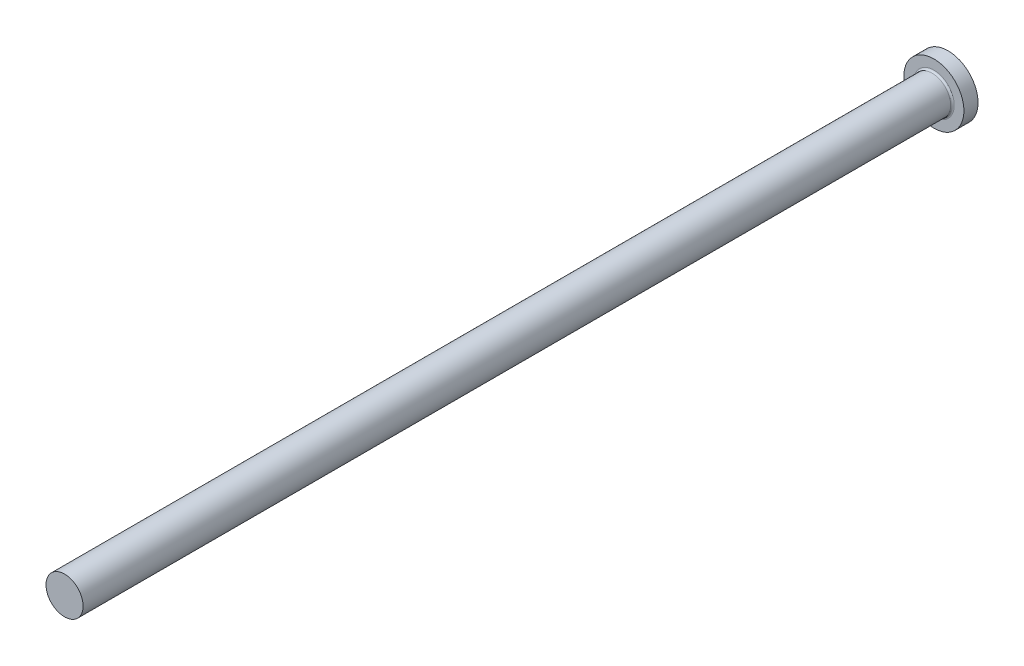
ISO-10303-21;
HEADER;
FILE_DESCRIPTION(('STEP AP214'),'2;1');
FILE_NAME('part.step','',(''),(''),'','','');
FILE_SCHEMA(('AUTOMOTIVE_DESIGN { 1 0 10303 214 1 1 1 1 }'));
ENDSEC;
DATA;
#1=APPLICATION_CONTEXT('core data for automotive mechanical design processes');
#2=APPLICATION_PROTOCOL_DEFINITION('international standard','automotive_design',2000,#1);
#3=PRODUCT_CONTEXT('',#1,'mechanical');
#4=PRODUCT('Part','Part','',(#3));
#5=PRODUCT_RELATED_PRODUCT_CATEGORY('part','',(#4));
#6=PRODUCT_DEFINITION_FORMATION('','',#4);
#7=PRODUCT_DEFINITION_CONTEXT('part definition',#1,'design');
#8=PRODUCT_DEFINITION('design','',#6,#7);
#9=PRODUCT_DEFINITION_SHAPE('','',#8);
#10=(LENGTH_UNIT() NAMED_UNIT(*) SI_UNIT(.MILLI.,.METRE.));
#11=(NAMED_UNIT(*) PLANE_ANGLE_UNIT() SI_UNIT($,.RADIAN.));
#12=(NAMED_UNIT(*) SI_UNIT($,.STERADIAN.) SOLID_ANGLE_UNIT());
#13=UNCERTAINTY_MEASURE_WITH_UNIT(LENGTH_MEASURE(1.E-05),#10,'distance_accuracy_value','');
#14=(GEOMETRIC_REPRESENTATION_CONTEXT(3) GLOBAL_UNCERTAINTY_ASSIGNED_CONTEXT((#13)) GLOBAL_UNIT_ASSIGNED_CONTEXT((#10,
#11,#12)) REPRESENTATION_CONTEXT('',''));
#15=CARTESIAN_POINT('',(0.,0.,0.));
#16=DIRECTION('',(0.,0.,1.));
#17=DIRECTION('',(1.,0.,0.));
#18=AXIS2_PLACEMENT_3D('',#15,#16,#17);
#19=CARTESIAN_POINT('',(8.5,0.,4.));
#20=DIRECTION('',(0.,0.,-1.));
#21=DIRECTION('',(-1.,0.,0.));
#22=AXIS2_PLACEMENT_3D('',#19,#20,#21);
#23=PLANE('',#22);
#24=CARTESIAN_POINT('',(0.,0.,4.));
#25=DIRECTION('',(0.,0.,-1.));
#26=DIRECTION('',(-1.,0.,0.));
#27=AXIS2_PLACEMENT_3D('',#24,#25,#26);
#28=CIRCLE('',#27,5.75000000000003);
#29=CARTESIAN_POINT('',(-5.75000000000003,0.,4.));
#30=VERTEX_POINT('',#29);
#31=EDGE_CURVE('E40',#30,#30,#28,.T.);
#32=ORIENTED_EDGE('',*,*,#31,.T.);
#33=EDGE_LOOP('',(#32));
#34=FACE_BOUND('',#33,.T.);
#35=CARTESIAN_POINT('',(0.,0.,4.));
#36=DIRECTION('',(0.,0.,-1.));
#37=DIRECTION('',(-1.,0.,0.));
#38=AXIS2_PLACEMENT_3D('',#35,#36,#37);
#39=CIRCLE('',#38,8.5);
#40=CARTESIAN_POINT('',(-8.5,0.,4.));
#41=VERTEX_POINT('',#40);
#42=EDGE_CURVE('E44',#41,#41,#39,.T.);
#43=ORIENTED_EDGE('',*,*,#42,.F.);
#44=EDGE_LOOP('',(#43));
#45=FACE_BOUND('',#44,.T.);
#46=ADVANCED_FACE('F33',(#34,#45),#23,.F.);
#47=CARTESIAN_POINT('',(0.,0.,-9.03322817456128));
#48=DIRECTION('',(0.,0.,-1.));
#49=DIRECTION('',(-1.,0.,0.));
#50=AXIS2_PLACEMENT_3D('',#47,#48,#49);
#51=CYLINDRICAL_SURFACE('',#50,8.5);
#52=CARTESIAN_POINT('',(0.,0.,0.));
#53=DIRECTION('',(0.,0.,-1.));
#54=DIRECTION('',(-1.,0.,0.));
#55=AXIS2_PLACEMENT_3D('',#52,#53,#54);
#56=CIRCLE('',#55,8.5);
#57=CARTESIAN_POINT('',(-8.5,0.,0.));
#58=VERTEX_POINT('',#57);
#59=EDGE_CURVE('E48',#58,#58,#56,.T.);
#60=ORIENTED_EDGE('',*,*,#59,.F.);
#61=EDGE_LOOP('',(#60));
#62=FACE_BOUND('',#61,.T.);
#63=ORIENTED_EDGE('',*,*,#42,.T.);
#64=EDGE_LOOP('',(#63));
#65=FACE_BOUND('',#64,.T.);
#66=ADVANCED_FACE('F68',(#62,#65),#51,.T.);
#67=CARTESIAN_POINT('',(0.,0.,0.));
#68=DIRECTION('',(0.,0.,1.));
#69=DIRECTION('',(1.,0.,0.));
#70=AXIS2_PLACEMENT_3D('',#67,#68,#69);
#71=PLANE('',#70);
#72=ORIENTED_EDGE('',*,*,#59,.T.);
#73=EDGE_LOOP('',(#72));
#74=FACE_BOUND('',#73,.T.);
#75=ADVANCED_FACE('F61',(#74),#71,.F.);
#76=CARTESIAN_POINT('',(0.,0.,250.));
#77=DIRECTION('',(0.,0.,-1.));
#78=DIRECTION('',(-1.,0.,0.));
#79=AXIS2_PLACEMENT_3D('',#76,#77,#78);
#80=PLANE('',#79);
#81=CARTESIAN_POINT('',(0.,0.,250.));
#82=DIRECTION('',(0.,0.,-1.));
#83=DIRECTION('',(-1.,0.,0.));
#84=AXIS2_PLACEMENT_3D('',#81,#82,#83);
#85=CIRCLE('',#84,5.25000000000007);
#86=CARTESIAN_POINT('',(-5.25000000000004,0.,250.));
#87=VERTEX_POINT('',#86);
#88=EDGE_CURVE('E53',#87,#87,#85,.T.);
#89=ORIENTED_EDGE('',*,*,#88,.F.);
#90=EDGE_LOOP('',(#89));
#91=FACE_BOUND('',#90,.T.);
#92=ADVANCED_FACE('F59',(#91),#80,.F.);
#93=CARTESIAN_POINT('',(0.,0.,-9.03322817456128));
#94=DIRECTION('',(0.,0.,-1.));
#95=DIRECTION('',(-1.,0.,0.));
#96=AXIS2_PLACEMENT_3D('',#93,#94,#95);
#97=CYLINDRICAL_SURFACE('',#96,5.25000000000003);
#98=CARTESIAN_POINT('',(0.,0.,4.5));
#99=DIRECTION('',(0.,0.,-1.));
#100=DIRECTION('',(-1.,0.,0.));
#101=AXIS2_PLACEMENT_3D('',#98,#99,#100);
#102=CIRCLE('',#101,5.25000000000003);
#103=CARTESIAN_POINT('',(-5.25000000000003,0.,4.5));
#104=VERTEX_POINT('',#103);
#105=EDGE_CURVE('E10',#104,#104,#102,.F.);
#106=ORIENTED_EDGE('',*,*,#105,.T.);
#107=EDGE_LOOP('',(#106));
#108=FACE_BOUND('',#107,.T.);
#109=ORIENTED_EDGE('',*,*,#88,.T.);
#110=EDGE_LOOP('',(#109));
#111=FACE_BOUND('',#110,.T.);
#112=ADVANCED_FACE('F57',(#108,#111),#97,.T.);
#113=CARTESIAN_POINT('',(0.,0.,4.5));
#114=DIRECTION('',(0.,0.,-1.));
#115=DIRECTION('',(-1.,0.,0.));
#116=AXIS2_PLACEMENT_3D('',#113,#114,#115);
#117=TOROIDAL_SURFACE('',#116,5.75000000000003,0.5);
#118=ORIENTED_EDGE('',*,*,#105,.F.);
#119=EDGE_LOOP('',(#118));
#120=FACE_BOUND('',#119,.T.);
#121=ORIENTED_EDGE('',*,*,#31,.F.);
#122=EDGE_LOOP('',(#121));
#123=FACE_BOUND('',#122,.T.);
#124=ADVANCED_FACE('F35',(#120,#123),#117,.F.);
#125=CLOSED_SHELL('',(#46,#66,#75,#92,#112,#124));
#126=MANIFOLD_SOLID_BREP('B2',#125);
#127=ADVANCED_BREP_SHAPE_REPRESENTATION('',(#18,#126),#14);
#128=SHAPE_DEFINITION_REPRESENTATION(#9,#127);
ENDSEC;
END-ISO-10303-21;
